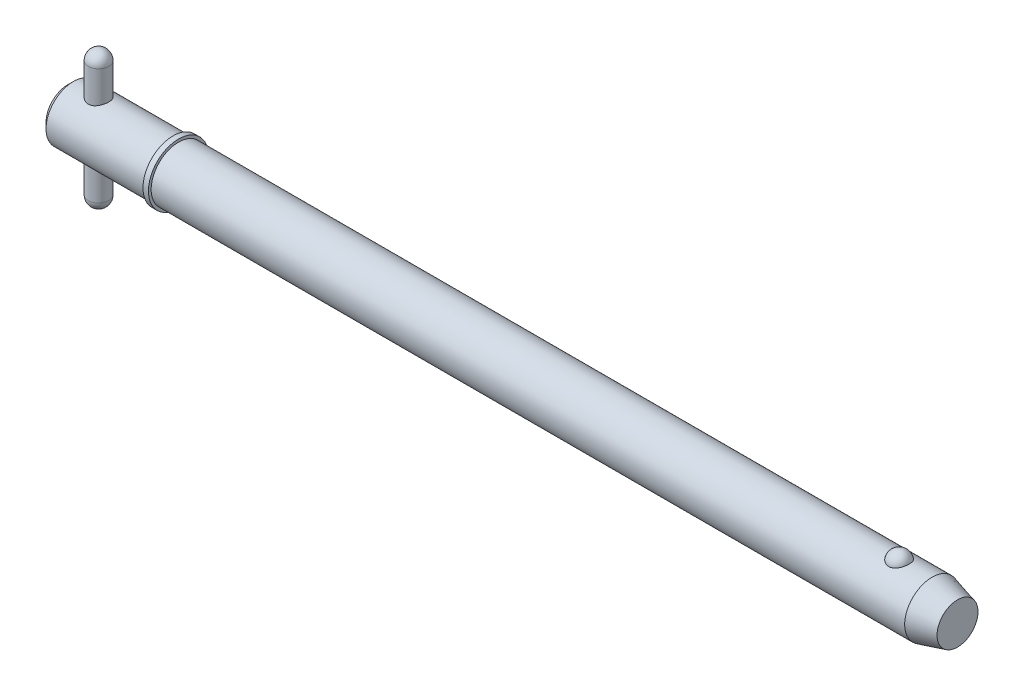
ISO-10303-21;
HEADER;
FILE_DESCRIPTION(('STEP AP214'),'2;1');
FILE_NAME('part.step','',(''),(''),'','','');
FILE_SCHEMA(('AUTOMOTIVE_DESIGN { 1 0 10303 214 1 1 1 1 }'));
ENDSEC;
DATA;
#1=APPLICATION_CONTEXT('core data for automotive mechanical design processes');
#2=APPLICATION_PROTOCOL_DEFINITION('international standard','automotive_design',2000,#1);
#3=PRODUCT_CONTEXT('',#1,'mechanical');
#4=PRODUCT('Part','Part','',(#3));
#5=PRODUCT_RELATED_PRODUCT_CATEGORY('part','',(#4));
#6=PRODUCT_DEFINITION_FORMATION('','',#4);
#7=PRODUCT_DEFINITION_CONTEXT('part definition',#1,'design');
#8=PRODUCT_DEFINITION('design','',#6,#7);
#9=PRODUCT_DEFINITION_SHAPE('','',#8);
#10=(LENGTH_UNIT() NAMED_UNIT(*) SI_UNIT(.MILLI.,.METRE.));
#11=(NAMED_UNIT(*) PLANE_ANGLE_UNIT() SI_UNIT($,.RADIAN.));
#12=(NAMED_UNIT(*) SI_UNIT($,.STERADIAN.) SOLID_ANGLE_UNIT());
#13=UNCERTAINTY_MEASURE_WITH_UNIT(LENGTH_MEASURE(1.E-05),#10,'distance_accuracy_value','');
#14=(GEOMETRIC_REPRESENTATION_CONTEXT(3) GLOBAL_UNCERTAINTY_ASSIGNED_CONTEXT((#13)) GLOBAL_UNIT_ASSIGNED_CONTEXT((#10,
#11,#12)) REPRESENTATION_CONTEXT('',''));
#15=CARTESIAN_POINT('',(0.,0.,0.));
#16=DIRECTION('',(0.,0.,1.));
#17=DIRECTION('',(1.,0.,0.));
#18=AXIS2_PLACEMENT_3D('',#15,#16,#17);
#19=CARTESIAN_POINT('',(7.14,15.875,0.));
#20=DIRECTION('',(0.,-1.,0.));
#21=DIRECTION('',(0.,0.,-1.));
#22=AXIS2_PLACEMENT_3D('',#19,#20,#21);
#23=CYLINDRICAL_SURFACE('',#22,2.38);
#24=CARTESIAN_POINT('',(7.14,-13.495,0.));
#25=DIRECTION('',(0.,-1.,0.));
#26=DIRECTION('',(0.,0.,-1.));
#27=AXIS2_PLACEMENT_3D('',#24,#25,#26);
#28=CIRCLE('',#27,2.38);
#29=CARTESIAN_POINT('',(7.14,-13.495,-2.38));
#30=VERTEX_POINT('',#29);
#31=EDGE_CURVE('P0_E10',#30,#30,#28,.F.);
#32=ORIENTED_EDGE('',*,*,#31,.T.);
#33=EDGE_LOOP('',(#32));
#34=FACE_BOUND('',#33,.T.);
#35=CARTESIAN_POINT('',(7.14,13.495,0.));
#36=DIRECTION('',(0.,-1.,0.));
#37=DIRECTION('',(0.,0.,-1.));
#38=AXIS2_PLACEMENT_3D('',#35,#36,#37);
#39=CIRCLE('',#38,2.38);
#40=CARTESIAN_POINT('',(7.14,13.495,-2.38));
#41=VERTEX_POINT('',#40);
#42=EDGE_CURVE('P0_E21',#41,#41,#39,.T.);
#43=ORIENTED_EDGE('',*,*,#42,.T.);
#44=EDGE_LOOP('',(#43));
#45=FACE_BOUND('',#44,.T.);
#46=ADVANCED_FACE('P0_F14',(#34,#45),#23,.T.);
#47=CARTESIAN_POINT('',(7.14,-13.495,0.));
#48=DIRECTION('',(0.,0.,1.));
#49=DIRECTION('',(1.,0.,0.));
#50=AXIS2_PLACEMENT_3D('',#47,#48,#49);
#51=SPHERICAL_SURFACE('',#50,2.38);
#52=CARTESIAN_POINT('',(7.14,-13.495,0.));
#53=DIRECTION('',(0.,-1.,0.));
#54=DIRECTION('',(0.,0.,-1.));
#55=AXIS2_PLACEMENT_3D('',#52,#53,#54);
#56=SPHERICAL_SURFACE('',#55,2.38);
#57=ORIENTED_EDGE('',*,*,#31,.F.);
#58=EDGE_LOOP('',(#57));
#59=FACE_BOUND('',#58,.T.);
#60=ADVANCED_FACE('P0_F29',(#59),#56,.T.);
#61=CARTESIAN_POINT('',(7.14,13.495,0.));
#62=DIRECTION('',(0.,0.,1.));
#63=DIRECTION('',(1.,0.,0.));
#64=AXIS2_PLACEMENT_3D('',#61,#62,#63);
#65=SPHERICAL_SURFACE('',#64,2.38);
#66=CARTESIAN_POINT('',(7.14,13.495,0.));
#67=DIRECTION('',(0.,-1.,0.));
#68=DIRECTION('',(0.,0.,-1.));
#69=AXIS2_PLACEMENT_3D('',#66,#67,#68);
#70=SPHERICAL_SURFACE('',#69,2.38);
#71=ORIENTED_EDGE('',*,*,#42,.F.);
#72=EDGE_LOOP('',(#71));
#73=FACE_BOUND('',#72,.T.);
#74=ADVANCED_FACE('P0_F16',(#73),#70,.T.);
#75=CLOSED_SHELL('',(#46,#60,#74));
#76=MANIFOLD_SOLID_BREP('P0_B1',#75);
#77=CARTESIAN_POINT('',(0.,0.,0.));
#78=DIRECTION('',(1.,0.,0.));
#79=DIRECTION('',(0.,0.,-1.));
#80=AXIS2_PLACEMENT_3D('',#77,#78,#79);
#81=CYLINDRICAL_SURFACE('',#80,6.35);
#82=CARTESIAN_POINT('',(200.755369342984,0.,0.));
#83=DIRECTION('',(1.,0.,0.));
#84=DIRECTION('',(0.,0.,-1.));
#85=AXIS2_PLACEMENT_3D('',#82,#83,#84);
#86=CIRCLE('',#85,6.35);
#87=CARTESIAN_POINT('',(200.755369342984,0.,-6.35));
#88=VERTEX_POINT('',#87);
#89=EDGE_CURVE('P1_E81',#88,#88,#86,.T.);
#90=ORIENTED_EDGE('',*,*,#89,.F.);
#91=EDGE_LOOP('',(#90));
#92=FACE_BOUND('',#91,.T.);
#93=CARTESIAN_POINT('',(25.7,0.,0.));
#94=DIRECTION('',(1.,0.,0.));
#95=DIRECTION('',(0.,0.,-1.));
#96=AXIS2_PLACEMENT_3D('',#93,#94,#95);
#97=CIRCLE('',#96,6.35);
#98=CARTESIAN_POINT('',(25.7,0.,-6.35));
#99=VERTEX_POINT('',#98);
#100=EDGE_CURVE('P1_E85',#99,#99,#97,.T.);
#101=ORIENTED_EDGE('',*,*,#100,.T.);
#102=EDGE_LOOP('',(#101));
#103=FACE_BOUND('',#102,.T.);
#104=CARTESIAN_POINT('',(193.130021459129,5.87502187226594,2.40969251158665));
#105=CARTESIAN_POINT('',(193.005030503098,5.87501645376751,2.40969773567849));
#106=CARTESIAN_POINT('',(192.880080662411,5.87916061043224,2.39967292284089));
#107=CARTESIAN_POINT('',(192.633909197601,5.89523112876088,2.35991730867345));
#108=CARTESIAN_POINT('',(192.512686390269,5.90715499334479,2.33019283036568));
#109=CARTESIAN_POINT('',(192.277517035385,5.93739567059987,2.25201402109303));
#110=CARTESIAN_POINT('',(192.163560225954,5.95570321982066,2.20358681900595));
#111=CARTESIAN_POINT('',(191.94557352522,5.9967206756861,2.08937987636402));
#112=CARTESIAN_POINT('',(191.841545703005,6.0194314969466,2.02359652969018));
#113=CARTESIAN_POINT('',(191.642943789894,6.06760647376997,1.87428969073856));
#114=CARTESIAN_POINT('',(191.548726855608,6.09313095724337,1.79031110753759));
#115=CARTESIAN_POINT('',(191.375255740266,6.14375873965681,1.60800178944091));
#116=CARTESIAN_POINT('',(191.296004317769,6.16886196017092,1.50966841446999));
#117=CARTESIAN_POINT('',(191.150845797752,6.21724600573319,1.29645884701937));
#118=CARTESIAN_POINT('',(191.085688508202,6.24039621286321,1.1810415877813));
#119=CARTESIAN_POINT('',(190.974703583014,6.28117277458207,0.940351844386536));
#120=CARTESIAN_POINT('',(190.928877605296,6.29879865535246,0.815078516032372));
#121=CARTESIAN_POINT('',(190.857023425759,6.32692073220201,0.556494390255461));
#122=CARTESIAN_POINT('',(190.831249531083,6.33732517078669,0.423102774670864));
#123=CARTESIAN_POINT('',(190.800988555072,6.34957673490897,0.153542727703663));
#124=CARTESIAN_POINT('',(190.796500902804,6.35142408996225,0.0173743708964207));
#125=CARTESIAN_POINT('',(190.808865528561,6.34638925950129,-0.253036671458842));
#126=CARTESIAN_POINT('',(190.825594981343,6.33955731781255,-0.387285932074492));
#127=CARTESIAN_POINT('',(190.879843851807,6.31794129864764,-0.650851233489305));
#128=CARTESIAN_POINT('',(190.917363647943,6.3031570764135,-0.780167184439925));
#129=CARTESIAN_POINT('',(191.012500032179,6.26711642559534,-1.03041949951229));
#130=CARTESIAN_POINT('',(191.070143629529,6.24585130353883,-1.15134433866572));
#131=CARTESIAN_POINT('',(191.204352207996,6.19905619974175,-1.38129800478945));
#132=CARTESIAN_POINT('',(191.280918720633,6.17352587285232,-1.49032586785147));
#133=CARTESIAN_POINT('',(191.451753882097,6.12080227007,-1.69393164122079));
#134=CARTESIAN_POINT('',(191.546100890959,6.09360200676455,-1.78844209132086));
#135=CARTESIAN_POINT('',(191.750119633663,6.04070434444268,-1.95970536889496));
#136=CARTESIAN_POINT('',(191.859790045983,6.015006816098,-2.0364597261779));
#137=CARTESIAN_POINT('',(192.089187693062,5.96867714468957,-2.16845644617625));
#138=CARTESIAN_POINT('',(192.208652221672,5.94794910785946,-2.22412062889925));
#139=CARTESIAN_POINT('',(192.456218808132,5.91340580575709,-2.31440992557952));
#140=CARTESIAN_POINT('',(192.584317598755,5.89958794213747,-2.34904294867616));
#141=CARTESIAN_POINT('',(192.838582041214,5.88111049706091,-2.39491590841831));
#142=CARTESIAN_POINT('',(192.964520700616,5.87602512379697,-2.40724512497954));
#143=CARTESIAN_POINT('',(193.216786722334,5.87428980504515,-2.41147867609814));
#144=CARTESIAN_POINT('',(193.343114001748,5.8776381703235,-2.40338710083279));
#145=CARTESIAN_POINT('',(193.588417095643,5.89212921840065,-2.36762715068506));
#146=CARTESIAN_POINT('',(193.707499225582,5.90302431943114,-2.3405803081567));
#147=CARTESIAN_POINT('',(193.93924472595,5.93113752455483,-2.26839066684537));
#148=CARTESIAN_POINT('',(194.051907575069,5.94835614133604,-2.22324640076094));
#149=CARTESIAN_POINT('',(194.270400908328,5.9877301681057,-2.11493806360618));
#150=CARTESIAN_POINT('',(194.376028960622,6.00998499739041,-2.05140269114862));
#151=CARTESIAN_POINT('',(194.575300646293,6.05690144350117,-1.90842705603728));
#152=CARTESIAN_POINT('',(194.668941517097,6.08156361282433,-1.82898313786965));
#153=CARTESIAN_POINT('',(194.846675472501,6.13211715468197,-1.65182429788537));
#154=CARTESIAN_POINT('',(194.930055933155,6.15800825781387,-1.5533938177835));
#155=CARTESIAN_POINT('',(195.079790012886,6.20712834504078,-1.34374214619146));
#156=CARTESIAN_POINT('',(195.146140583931,6.23035685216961,-1.23251867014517));
#157=CARTESIAN_POINT('',(195.262345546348,6.27251177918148,-0.996447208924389));
#158=CARTESIAN_POINT('',(195.311607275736,6.29127762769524,-0.871278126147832));
#159=CARTESIAN_POINT('',(195.389614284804,6.3215862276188,-0.613870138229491));
#160=CARTESIAN_POINT('',(195.418359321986,6.33312889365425,-0.481631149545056));
#161=CARTESIAN_POINT('',(195.454770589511,6.34782349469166,-0.213672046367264));
#162=CARTESIAN_POINT('',(195.462413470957,6.35096613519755,-0.0779482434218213));
#163=CARTESIAN_POINT('',(195.456395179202,6.34851322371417,0.192943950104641));
#164=CARTESIAN_POINT('',(195.442734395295,6.3429178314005,0.328112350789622));
#165=CARTESIAN_POINT('',(195.39450361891,6.32360512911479,0.593406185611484));
#166=CARTESIAN_POINT('',(195.360031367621,6.30992579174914,0.723552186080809));
#167=CARTESIAN_POINT('',(195.270953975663,6.27586325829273,0.97583417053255));
#168=CARTESIAN_POINT('',(195.21634761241,6.25547965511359,1.09796966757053));
#169=CARTESIAN_POINT('',(195.08775879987,6.20998183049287,1.33148921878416));
#170=CARTESIAN_POINT('',(195.013674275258,6.18484288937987,1.44281227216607));
#171=CARTESIAN_POINT('',(194.847820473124,6.13258735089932,1.65087683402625));
#172=CARTESIAN_POINT('',(194.756051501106,6.10547078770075,1.7476185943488));
#173=CARTESIAN_POINT('',(194.557183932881,6.05235879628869,1.92350926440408));
#174=CARTESIAN_POINT('',(194.450133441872,6.02636017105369,2.00271146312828));
#175=CARTESIAN_POINT('',(194.223138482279,5.97843747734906,2.14154159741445));
#176=CARTESIAN_POINT('',(194.103191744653,5.9565141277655,2.20116608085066));
#177=CARTESIAN_POINT('',(193.844523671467,5.91812106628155,2.30250570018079));
#178=CARTESIAN_POINT('',(193.70506980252,5.90217533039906,2.34256795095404));
#179=CARTESIAN_POINT('',(193.420397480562,5.88063128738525,2.3961521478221));
#180=CARTESIAN_POINT('',(193.27518174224,5.87502816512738,2.40968644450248));
#181=CARTESIAN_POINT('',(193.130021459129,5.87502187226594,2.40969251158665));
#182=B_SPLINE_CURVE_WITH_KNOTS('',3,(#104,#105,#106,#107,#108,#109,#110,#111,#112,#113,#114,
#115,#116,#117,#118,#119,#120,#121,#122,#123,#124,#125,#126,#127,#128,#129,#130,#131,#132,#133,
#134,#135,#136,#137,#138,#139,#140,#141,#142,#143,#144,#145,#146,#147,#148,#149,#150,#151,#152,
#153,#154,#155,#156,#157,#158,#159,#160,#161,#162,#163,#164,#165,#166,#167,#168,#169,#170,#171,
#172,#173,#174,#175,#176,#177,#178,#179,#180,#181),.UNSPECIFIED.,.T.,.F.,(4,2,2,2,2,2,2,2,2,2,2,
2,2,2,2,2,2,2,2,2,2,2,2,2,2,2,2,2,2,2,2,2,2,2,2,2,2,2,4),(0.,0.374440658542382,
0.748761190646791,1.12254078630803,1.4963981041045,1.88098871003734,2.26565013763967,
2.66741104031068,3.06920639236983,3.47601794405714,3.88281858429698,4.28727498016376,
4.69173873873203,5.09674745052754,5.50178895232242,5.90865911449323,6.31549420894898,
6.71369855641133,7.11175305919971,7.48978077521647,7.86773278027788,8.23383886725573,
8.59997464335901,8.97409044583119,9.34829231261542,9.74122667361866,10.1342313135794,
10.5397522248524,10.9452779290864,11.3512521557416,11.75721896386,12.1612938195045,
12.5653932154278,12.9716540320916,13.3779078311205,13.7829098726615,14.1879832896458,
14.6230486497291,15.0579114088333),.UNSPECIFIED.);
#183=CARTESIAN_POINT('',(193.130021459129,5.87502187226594,2.40969251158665));
#184=VERTEX_POINT('',#183);
#185=EDGE_CURVE('P1_E35',#184,#184,#182,.T.);
#186=ORIENTED_EDGE('',*,*,#185,.T.);
#187=EDGE_LOOP('',(#186));
#188=FACE_BOUND('',#187,.T.);
#189=ADVANCED_FACE('P1_F13',(#92,#103,#188),#81,.T.);
#190=CARTESIAN_POINT('',(0.,0.,0.));
#191=DIRECTION('',(-1.,0.,0.));
#192=DIRECTION('',(0.,0.,1.));
#193=AXIS2_PLACEMENT_3D('',#190,#191,#192);
#194=PLANE('',#193);
#195=CARTESIAN_POINT('',(0.,0.,0.));
#196=DIRECTION('',(1.,0.,0.));
#197=DIRECTION('',(0.,0.,-1.));
#198=AXIS2_PLACEMENT_3D('',#195,#196,#197);
#199=CIRCLE('',#198,5.08);
#200=CARTESIAN_POINT('',(0.,0.,-5.08));
#201=VERTEX_POINT('',#200);
#202=EDGE_CURVE('P1_E9',#201,#201,#199,.T.);
#203=ORIENTED_EDGE('',*,*,#202,.F.);
#204=EDGE_LOOP('',(#203));
#205=FACE_BOUND('',#204,.T.);
#206=ADVANCED_FACE('P1_F15',(#205),#194,.T.);
#207=CARTESIAN_POINT('',(1.27,0.,0.));
#208=DIRECTION('',(1.,0.,0.));
#209=DIRECTION('',(0.,0.,-1.));
#210=AXIS2_PLACEMENT_3D('',#207,#208,#209);
#211=CONICAL_SURFACE('',#210,6.35,0.78539816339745);
#212=ORIENTED_EDGE('',*,*,#202,.T.);
#213=EDGE_LOOP('',(#212));
#214=FACE_BOUND('',#213,.T.);
#215=CARTESIAN_POINT('',(1.27,0.,0.));
#216=DIRECTION('',(1.,0.,0.));
#217=DIRECTION('',(0.,0.,-1.));
#218=AXIS2_PLACEMENT_3D('',#215,#216,#217);
#219=CIRCLE('',#218,6.35);
#220=CARTESIAN_POINT('',(1.27,0.,-6.35));
#221=VERTEX_POINT('',#220);
#222=EDGE_CURVE('P1_E26',#221,#221,#219,.T.);
#223=ORIENTED_EDGE('',*,*,#222,.F.);
#224=EDGE_LOOP('',(#223));
#225=FACE_BOUND('',#224,.T.);
#226=ADVANCED_FACE('P1_F77',(#214,#225),#211,.T.);
#227=CARTESIAN_POINT('',(0.,0.,0.));
#228=DIRECTION('',(1.,0.,0.));
#229=DIRECTION('',(0.,0.,-1.));
#230=AXIS2_PLACEMENT_3D('',#227,#228,#229);
#231=CYLINDRICAL_SURFACE('',#230,6.35);
#232=CARTESIAN_POINT('',(7.14,-5.88711304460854,2.38));
#233=CARTESIAN_POINT('',(7.01146258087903,-5.88710856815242,2.38000480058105));
#234=CARTESIAN_POINT('',(6.88295682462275,-5.89136840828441,2.36955244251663));
#235=CARTESIAN_POINT('',(6.62981934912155,-5.90782785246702,2.32820953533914));
#236=CARTESIAN_POINT('',(6.50518751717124,-5.92002722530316,2.29731958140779));
#237=CARTESIAN_POINT('',(6.26352403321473,-5.95079384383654,2.21639366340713));
#238=CARTESIAN_POINT('',(6.14647496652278,-5.96934583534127,2.16640353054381));
#239=CARTESIAN_POINT('',(5.92237941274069,-6.01070278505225,2.04885862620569));
#240=CARTESIAN_POINT('',(5.81533593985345,-6.03350901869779,1.98129858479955));
#241=CARTESIAN_POINT('',(5.60897525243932,-6.08207341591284,1.82693902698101));
#242=CARTESIAN_POINT('',(5.51022503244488,-6.10791836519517,1.73940861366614));
#243=CARTESIAN_POINT('',(5.32840561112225,-6.15892405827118,1.54914379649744));
#244=CARTESIAN_POINT('',(5.24533975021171,-6.1840846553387,1.44640616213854));
#245=CARTESIAN_POINT('',(5.09451639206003,-6.23191821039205,1.22434014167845));
#246=CARTESIAN_POINT('',(5.02737511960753,-6.25447755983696,1.10456656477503));
#247=CARTESIAN_POINT('',(4.91443001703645,-6.2935236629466,0.854429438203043));
#248=CARTESIAN_POINT('',(4.86861879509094,-6.31001251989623,0.724069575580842));
#249=CARTESIAN_POINT('',(4.80162253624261,-6.33444370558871,0.46242122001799));
#250=CARTESIAN_POINT('',(4.77946137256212,-6.34272370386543,0.331414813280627));
#251=CARTESIAN_POINT('',(4.75726677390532,-6.35101600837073,0.0672982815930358));
#252=CARTESIAN_POINT('',(4.75722615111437,-6.35103100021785,-0.0658111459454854));
#253=CARTESIAN_POINT('',(4.77870510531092,-6.3430064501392,-0.323358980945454));
#254=CARTESIAN_POINT('',(4.79915922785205,-6.33536494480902,-0.447900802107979));
#255=CARTESIAN_POINT('',(4.85925493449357,-6.31340794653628,-0.69163609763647));
#256=CARTESIAN_POINT('',(4.89889787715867,-6.29909198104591,-0.810829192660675));
#257=CARTESIAN_POINT('',(4.9967414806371,-6.26494471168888,-1.04254212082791));
#258=CARTESIAN_POINT('',(5.05520370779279,-6.24503620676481,-1.1549396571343));
#259=CARTESIAN_POINT('',(5.1887948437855,-6.20171869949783,-1.3686079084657));
#260=CARTESIAN_POINT('',(5.26392912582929,-6.17830856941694,-1.46987502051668));
#261=CARTESIAN_POINT('',(5.43386591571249,-6.12878580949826,-1.66468415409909));
#262=CARTESIAN_POINT('',(5.52956139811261,-6.10259519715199,-1.75742857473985));
#263=CARTESIAN_POINT('',(5.73530435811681,-6.05155777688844,-1.92585331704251));
#264=CARTESIAN_POINT('',(5.84535542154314,-6.02671130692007,-2.00152936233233));
#265=CARTESIAN_POINT('',(6.07982989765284,-5.98068420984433,-2.13519109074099));
#266=CARTESIAN_POINT('',(6.20451768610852,-5.95959698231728,-2.19274775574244));
#267=CARTESIAN_POINT('',(6.4628145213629,-5.92455622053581,-2.28574558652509));
#268=CARTESIAN_POINT('',(6.59641856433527,-5.91059872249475,-2.32119904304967));
#269=CARTESIAN_POINT('',(6.86087441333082,-5.8923327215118,-2.36717069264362));
#270=CARTESIAN_POINT('',(6.99147192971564,-5.8875347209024,-2.37895573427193));
#271=CARTESIAN_POINT('',(7.25283805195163,-5.88674545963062,-2.38091046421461));
#272=CARTESIAN_POINT('',(7.38360660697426,-5.89075200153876,-2.37108554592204));
#273=CARTESIAN_POINT('',(7.63510696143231,-5.90662331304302,-2.33124781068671));
#274=CARTESIAN_POINT('',(7.75602069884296,-5.91810660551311,-2.30221396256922));
#275=CARTESIAN_POINT('',(7.99120505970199,-5.94718527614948,-2.22601401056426));
#276=CARTESIAN_POINT('',(8.10547431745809,-5.96478190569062,-2.17884419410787));
#277=CARTESIAN_POINT('',(8.32888632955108,-6.00491533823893,-2.06572311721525));
#278=CARTESIAN_POINT('',(8.43767672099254,-6.02761250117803,-1.99913452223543));
#279=CARTESIAN_POINT('',(8.6429894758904,-6.07511988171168,-1.84974438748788));
#280=CARTESIAN_POINT('',(8.73950733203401,-6.09993087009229,-1.76693691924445));
#281=CARTESIAN_POINT('',(8.9238741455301,-6.1507686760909,-1.58125563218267));
#282=CARTESIAN_POINT('',(9.01078732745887,-6.17677301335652,-1.47744327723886));
#283=CARTESIAN_POINT('',(9.16607127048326,-6.22556172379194,-1.25606967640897));
#284=CARTESIAN_POINT('',(9.23444197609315,-6.24834608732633,-1.13850838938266));
#285=CARTESIAN_POINT('',(9.3502493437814,-6.28811144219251,-0.893050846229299));
#286=CARTESIAN_POINT('',(9.39775808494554,-6.30511236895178,-0.765192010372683));
#287=CARTESIAN_POINT('',(9.47032640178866,-6.33145833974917,-0.502514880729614));
#288=CARTESIAN_POINT('',(9.49539651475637,-6.34080697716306,-0.367699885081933));
#289=CARTESIAN_POINT('',(9.52124059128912,-6.35045496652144,-0.103396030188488));
#290=CARTESIAN_POINT('',(9.52334421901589,-6.35124952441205,0.025945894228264));
#291=CARTESIAN_POINT('',(9.50661518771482,-6.34499064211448,0.283061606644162));
#292=CARTESIAN_POINT('',(9.48778504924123,-6.33793814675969,0.410835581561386));
#293=CARTESIAN_POINT('',(9.43065630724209,-6.31700307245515,0.658028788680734));
#294=CARTESIAN_POINT('',(9.39284291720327,-6.30329098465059,0.7775756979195));
#295=CARTESIAN_POINT('',(9.29930406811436,-6.27046903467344,1.00863789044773));
#296=CARTESIAN_POINT('',(9.2435752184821,-6.25135815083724,1.12015164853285));
#297=CARTESIAN_POINT('',(9.11312349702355,-6.20865254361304,1.33711407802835));
#298=CARTESIAN_POINT('',(9.03770094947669,-6.18490316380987,1.44211105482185));
#299=CARTESIAN_POINT('',(8.87110640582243,-6.13583718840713,1.63836897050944));
#300=CARTESIAN_POINT('',(8.77992879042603,-6.11052003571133,1.72962498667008));
#301=CARTESIAN_POINT('',(8.57869799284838,-6.05953829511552,1.90076098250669));
#302=CARTESIAN_POINT('',(8.46790320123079,-6.03392573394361,1.97978778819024));
#303=CARTESIAN_POINT('',(8.23379693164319,-5.98676607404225,2.11813466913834));
#304=CARTESIAN_POINT('',(8.11048418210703,-5.9652193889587,2.17745273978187));
#305=CARTESIAN_POINT('',(7.84900037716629,-5.92818393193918,2.27641807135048));
#306=CARTESIAN_POINT('',(7.71041678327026,-5.91299857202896,2.31510015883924));
#307=CARTESIAN_POINT('',(7.42787316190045,-5.89246887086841,2.36688002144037));
#308=CARTESIAN_POINT('',(7.28391673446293,-5.88711805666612,2.37999462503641));
#309=CARTESIAN_POINT('',(7.14,-5.88711304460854,2.38));
#310=B_SPLINE_CURVE_WITH_KNOTS('',3,(#232,#233,#234,#235,#236,#237,#238,#239,#240,#241,#242,
#243,#244,#245,#246,#247,#248,#249,#250,#251,#252,#253,#254,#255,#256,#257,#258,#259,#260,#261,
#262,#263,#264,#265,#266,#267,#268,#269,#270,#271,#272,#273,#274,#275,#276,#277,#278,#279,#280,
#281,#282,#283,#284,#285,#286,#287,#288,#289,#290,#291,#292,#293,#294,#295,#296,#297,#298,#299,
#300,#301,#302,#303,#304,#305,#306,#307,#308,#309),.UNSPECIFIED.,.T.,.F.,(4,2,2,2,2,2,2,2,2,2,2,
2,2,2,2,2,2,2,2,2,2,2,2,2,2,2,2,2,2,2,2,2,2,2,2,2,2,2,4),(0.,0.385076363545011,
0.770141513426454,1.15428843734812,1.53855071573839,1.94016118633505,2.3418570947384,
2.75720522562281,3.1724093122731,3.569721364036,3.96690431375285,4.34445758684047,
4.72203759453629,5.10511017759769,5.48830640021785,5.89390240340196,6.29959991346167,
6.71428455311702,7.12873839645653,7.52034494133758,7.91185376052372,8.28480528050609,
8.65783318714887,9.0448340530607,9.43197664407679,9.84363087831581,10.2552863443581,
10.6655081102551,11.0755371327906,11.4616919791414,11.847800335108,12.224507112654,
12.6012852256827,12.9938941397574,13.386643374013,13.8000944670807,14.2135876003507,
14.6450218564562,15.0761720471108),.UNSPECIFIED.);
#311=CARTESIAN_POINT('',(7.14,-5.88711304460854,2.38));
#312=VERTEX_POINT('',#311);
#313=EDGE_CURVE('P1_E17',#312,#312,#310,.T.);
#314=ORIENTED_EDGE('',*,*,#313,.F.);
#315=EDGE_LOOP('',(#314));
#316=FACE_BOUND('',#315,.T.);
#317=CARTESIAN_POINT('',(7.14,5.88711304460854,2.38));
#318=CARTESIAN_POINT('',(7.26853741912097,5.88710856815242,2.38000480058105));
#319=CARTESIAN_POINT('',(7.39704317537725,5.89136840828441,2.36955244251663));
#320=CARTESIAN_POINT('',(7.65018065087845,5.90782785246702,2.32820953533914));
#321=CARTESIAN_POINT('',(7.77481248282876,5.92002722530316,2.29731958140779));
#322=CARTESIAN_POINT('',(8.01647596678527,5.95079384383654,2.21639366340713));
#323=CARTESIAN_POINT('',(8.13352503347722,5.96934583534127,2.16640353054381));
#324=CARTESIAN_POINT('',(8.35762058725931,6.01070278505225,2.04885862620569));
#325=CARTESIAN_POINT('',(8.46466406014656,6.03350901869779,1.98129858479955));
#326=CARTESIAN_POINT('',(8.67102474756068,6.08207341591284,1.82693902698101));
#327=CARTESIAN_POINT('',(8.76977496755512,6.10791836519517,1.73940861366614));
#328=CARTESIAN_POINT('',(8.95159438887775,6.15892405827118,1.54914379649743));
#329=CARTESIAN_POINT('',(9.03466024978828,6.1840846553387,1.44640616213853));
#330=CARTESIAN_POINT('',(9.18548360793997,6.23191821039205,1.22434014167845));
#331=CARTESIAN_POINT('',(9.25262488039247,6.25447755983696,1.10456656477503));
#332=CARTESIAN_POINT('',(9.36556998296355,6.2935236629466,0.854429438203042));
#333=CARTESIAN_POINT('',(9.41138120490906,6.31001251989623,0.72406957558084));
#334=CARTESIAN_POINT('',(9.47837746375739,6.33444370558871,0.462421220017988));
#335=CARTESIAN_POINT('',(9.50053862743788,6.34272370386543,0.331414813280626));
#336=CARTESIAN_POINT('',(9.52273322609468,6.35101600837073,0.0672982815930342));
#337=CARTESIAN_POINT('',(9.52277384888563,6.35103100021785,-0.0658111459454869));
#338=CARTESIAN_POINT('',(9.50129489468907,6.3430064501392,-0.323358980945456));
#339=CARTESIAN_POINT('',(9.48084077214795,6.33536494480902,-0.447900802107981));
#340=CARTESIAN_POINT('',(9.42074506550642,6.31340794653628,-0.691636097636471));
#341=CARTESIAN_POINT('',(9.38110212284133,6.29909198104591,-0.810829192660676));
#342=CARTESIAN_POINT('',(9.2832585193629,6.26494471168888,-1.04254212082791));
#343=CARTESIAN_POINT('',(9.22479629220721,6.24503620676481,-1.1549396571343));
#344=CARTESIAN_POINT('',(9.0912051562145,6.20171869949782,-1.3686079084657));
#345=CARTESIAN_POINT('',(9.0160708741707,6.17830856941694,-1.46987502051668));
#346=CARTESIAN_POINT('',(8.84613408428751,6.12878580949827,-1.66468415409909));
#347=CARTESIAN_POINT('',(8.75043860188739,6.10259519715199,-1.75742857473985));
#348=CARTESIAN_POINT('',(8.54469564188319,6.05155777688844,-1.92585331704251));
#349=CARTESIAN_POINT('',(8.43464457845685,6.02671130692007,-2.00152936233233));
#350=CARTESIAN_POINT('',(8.20017010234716,5.98068420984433,-2.13519109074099));
#351=CARTESIAN_POINT('',(8.07548231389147,5.95959698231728,-2.19274775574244));
#352=CARTESIAN_POINT('',(7.8171854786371,5.9245562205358,-2.28574558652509));
#353=CARTESIAN_POINT('',(7.68358143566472,5.91059872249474,-2.32119904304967));
#354=CARTESIAN_POINT('',(7.41912558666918,5.8923327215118,-2.36717069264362));
#355=CARTESIAN_POINT('',(7.28852807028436,5.8875347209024,-2.37895573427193));
#356=CARTESIAN_POINT('',(7.02716194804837,5.88674545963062,-2.38091046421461));
#357=CARTESIAN_POINT('',(6.89639339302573,5.89075200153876,-2.37108554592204));
#358=CARTESIAN_POINT('',(6.64489303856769,5.90662331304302,-2.33124781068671));
#359=CARTESIAN_POINT('',(6.52397930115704,5.91810660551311,-2.30221396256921));
#360=CARTESIAN_POINT('',(6.288794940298,5.94718527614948,-2.22601401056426));
#361=CARTESIAN_POINT('',(6.17452568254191,5.96478190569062,-2.17884419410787));
#362=CARTESIAN_POINT('',(5.95111367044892,6.00491533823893,-2.06572311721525));
#363=CARTESIAN_POINT('',(5.84232327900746,6.02761250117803,-1.99913452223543));
#364=CARTESIAN_POINT('',(5.6370105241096,6.07511988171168,-1.84974438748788));
#365=CARTESIAN_POINT('',(5.54049266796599,6.09993087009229,-1.76693691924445));
#366=CARTESIAN_POINT('',(5.3561258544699,6.1507686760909,-1.58125563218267));
#367=CARTESIAN_POINT('',(5.26921267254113,6.17677301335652,-1.47744327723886));
#368=CARTESIAN_POINT('',(5.11392872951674,6.22556172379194,-1.25606967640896));
#369=CARTESIAN_POINT('',(5.04555802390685,6.24834608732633,-1.13850838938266));
#370=CARTESIAN_POINT('',(4.9297506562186,6.28811144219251,-0.893050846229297));
#371=CARTESIAN_POINT('',(4.88224191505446,6.30511236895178,-0.76519201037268));
#372=CARTESIAN_POINT('',(4.80967359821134,6.33145833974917,-0.502514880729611));
#373=CARTESIAN_POINT('',(4.78460348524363,6.34080697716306,-0.36769988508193));
#374=CARTESIAN_POINT('',(4.75875940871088,6.35045496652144,-0.103396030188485));
#375=CARTESIAN_POINT('',(4.75665578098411,6.35124952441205,0.025945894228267));
#376=CARTESIAN_POINT('',(4.77338481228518,6.34499064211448,0.283061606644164));
#377=CARTESIAN_POINT('',(4.79221495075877,6.33793814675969,0.410835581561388));
#378=CARTESIAN_POINT('',(4.84934369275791,6.31700307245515,0.658028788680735));
#379=CARTESIAN_POINT('',(4.88715708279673,6.30329098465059,0.777575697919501));
#380=CARTESIAN_POINT('',(4.98069593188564,6.27046903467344,1.00863789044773));
#381=CARTESIAN_POINT('',(5.0364247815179,6.25135815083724,1.12015164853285));
#382=CARTESIAN_POINT('',(5.16687650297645,6.20865254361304,1.33711407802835));
#383=CARTESIAN_POINT('',(5.24229905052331,6.18490316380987,1.44211105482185));
#384=CARTESIAN_POINT('',(5.40889359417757,6.13583718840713,1.63836897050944));
#385=CARTESIAN_POINT('',(5.50007120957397,6.11052003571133,1.72962498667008));
#386=CARTESIAN_POINT('',(5.70130200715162,6.05953829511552,1.90076098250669));
#387=CARTESIAN_POINT('',(5.81209679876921,6.03392573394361,1.97978778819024));
#388=CARTESIAN_POINT('',(6.04620306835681,5.98676607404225,2.11813466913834));
#389=CARTESIAN_POINT('',(6.16951581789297,5.9652193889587,2.17745273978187));
#390=CARTESIAN_POINT('',(6.43099962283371,5.92818393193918,2.27641807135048));
#391=CARTESIAN_POINT('',(6.56958321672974,5.91299857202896,2.31510015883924));
#392=CARTESIAN_POINT('',(6.85212683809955,5.89246887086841,2.36688002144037));
#393=CARTESIAN_POINT('',(6.99608326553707,5.88711805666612,2.37999462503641));
#394=CARTESIAN_POINT('',(7.14,5.88711304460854,2.38));
#395=B_SPLINE_CURVE_WITH_KNOTS('',3,(#317,#318,#319,#320,#321,#322,#323,#324,#325,#326,#327,
#328,#329,#330,#331,#332,#333,#334,#335,#336,#337,#338,#339,#340,#341,#342,#343,#344,#345,#346,
#347,#348,#349,#350,#351,#352,#353,#354,#355,#356,#357,#358,#359,#360,#361,#362,#363,#364,#365,
#366,#367,#368,#369,#370,#371,#372,#373,#374,#375,#376,#377,#378,#379,#380,#381,#382,#383,#384,
#385,#386,#387,#388,#389,#390,#391,#392,#393,#394),.UNSPECIFIED.,.T.,.F.,(4,2,2,2,2,2,2,2,2,2,2,
2,2,2,2,2,2,2,2,2,2,2,2,2,2,2,2,2,2,2,2,2,2,2,2,2,2,2,4),(0.,0.385076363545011,
0.770141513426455,1.15428843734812,1.53855071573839,1.94016118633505,2.3418570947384,
2.75720522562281,3.1724093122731,3.56972136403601,3.96690431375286,4.34445758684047,
4.72203759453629,5.10511017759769,5.48830640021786,5.89390240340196,6.29959991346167,
6.71428455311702,7.12873839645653,7.52034494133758,7.91185376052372,8.2848052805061,
8.65783318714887,9.0448340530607,9.43197664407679,9.84363087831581,10.2552863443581,
10.6655081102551,11.0755371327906,11.4616919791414,11.847800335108,12.2245071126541,
12.6012852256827,12.9938941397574,13.386643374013,13.8000944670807,14.2135876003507,
14.6450218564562,15.0761720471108),.UNSPECIFIED.);
#396=CARTESIAN_POINT('',(7.14,5.88711304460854,2.38));
#397=VERTEX_POINT('',#396);
#398=EDGE_CURVE('P1_E43',#397,#397,#395,.T.);
#399=ORIENTED_EDGE('',*,*,#398,.F.);
#400=EDGE_LOOP('',(#399));
#401=FACE_BOUND('',#400,.T.);
#402=ORIENTED_EDGE('',*,*,#222,.T.);
#403=EDGE_LOOP('',(#402));
#404=FACE_BOUND('',#403,.T.);
#405=CARTESIAN_POINT('',(24.43,0.,0.));
#406=DIRECTION('',(1.,0.,0.));
#407=DIRECTION('',(0.,0.,-1.));
#408=AXIS2_PLACEMENT_3D('',#405,#406,#407);
#409=CIRCLE('',#408,6.35);
#410=CARTESIAN_POINT('',(24.43,0.,-6.35));
#411=VERTEX_POINT('',#410);
#412=EDGE_CURVE('P1_E31',#411,#411,#409,.T.);
#413=ORIENTED_EDGE('',*,*,#412,.F.);
#414=EDGE_LOOP('',(#413));
#415=FACE_BOUND('',#414,.T.);
#416=ADVANCED_FACE('P1_F103',(#316,#401,#404,#415),#231,.T.);
#417=CARTESIAN_POINT('',(24.43,6.35,0.));
#418=DIRECTION('',(-1.,0.,0.));
#419=DIRECTION('',(0.,0.,1.));
#420=AXIS2_PLACEMENT_3D('',#417,#418,#419);
#421=PLANE('',#420);
#422=ORIENTED_EDGE('',*,*,#412,.T.);
#423=EDGE_LOOP('',(#422));
#424=FACE_BOUND('',#423,.T.);
#425=CARTESIAN_POINT('',(24.43,0.,0.));
#426=DIRECTION('',(1.,0.,0.));
#427=DIRECTION('',(0.,0.,-1.));
#428=AXIS2_PLACEMENT_3D('',#425,#426,#427);
#429=CIRCLE('',#428,6.985);
#430=CARTESIAN_POINT('',(24.43,0.,-6.985));
#431=VERTEX_POINT('',#430);
#432=EDGE_CURVE('P1_E91',#431,#431,#429,.T.);
#433=ORIENTED_EDGE('',*,*,#432,.F.);
#434=EDGE_LOOP('',(#433));
#435=FACE_BOUND('',#434,.T.);
#436=ADVANCED_FACE('P1_F100',(#424,#435),#421,.T.);
#437=CARTESIAN_POINT('',(0.,0.,0.));
#438=DIRECTION('',(1.,0.,0.));
#439=DIRECTION('',(0.,0.,-1.));
#440=AXIS2_PLACEMENT_3D('',#437,#438,#439);
#441=CYLINDRICAL_SURFACE('',#440,6.985);
#442=ORIENTED_EDGE('',*,*,#432,.T.);
#443=EDGE_LOOP('',(#442));
#444=FACE_BOUND('',#443,.T.);
#445=CARTESIAN_POINT('',(25.7,0.,0.));
#446=DIRECTION('',(1.,0.,0.));
#447=DIRECTION('',(0.,0.,-1.));
#448=AXIS2_PLACEMENT_3D('',#445,#446,#447);
#449=CIRCLE('',#448,6.985);
#450=CARTESIAN_POINT('',(25.7,0.,-6.985));
#451=VERTEX_POINT('',#450);
#452=EDGE_CURVE('P1_E88',#451,#451,#449,.T.);
#453=ORIENTED_EDGE('',*,*,#452,.F.);
#454=EDGE_LOOP('',(#453));
#455=FACE_BOUND('',#454,.T.);
#456=ADVANCED_FACE('P1_F68',(#444,#455),#441,.T.);
#457=CARTESIAN_POINT('',(25.7,6.985,0.));
#458=DIRECTION('',(1.,0.,0.));
#459=DIRECTION('',(0.,0.,-1.));
#460=AXIS2_PLACEMENT_3D('',#457,#458,#459);
#461=PLANE('',#460);
#462=ORIENTED_EDGE('',*,*,#452,.T.);
#463=EDGE_LOOP('',(#462));
#464=FACE_BOUND('',#463,.T.);
#465=ORIENTED_EDGE('',*,*,#100,.F.);
#466=EDGE_LOOP('',(#465));
#467=FACE_BOUND('',#466,.T.);
#468=ADVANCED_FACE('P1_F62',(#464,#467),#461,.T.);
#469=CARTESIAN_POINT('',(206.68,0.,0.));
#470=DIRECTION('',(-1.,0.,0.));
#471=DIRECTION('',(0.,0.,1.));
#472=AXIS2_PLACEMENT_3D('',#469,#470,#471);
#473=CONICAL_SURFACE('',#472,4.76250000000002,0.26179938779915);
#474=ORIENTED_EDGE('',*,*,#89,.T.);
#475=EDGE_LOOP('',(#474));
#476=FACE_BOUND('',#475,.T.);
#477=CARTESIAN_POINT('',(206.68,0.,0.));
#478=DIRECTION('',(1.,0.,0.));
#479=DIRECTION('',(0.,0.,-1.));
#480=AXIS2_PLACEMENT_3D('',#477,#478,#479);
#481=CIRCLE('',#480,4.76250000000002);
#482=CARTESIAN_POINT('',(206.68,0.,-4.76250000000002));
#483=VERTEX_POINT('',#482);
#484=EDGE_CURVE('P1_E42',#483,#483,#481,.T.);
#485=ORIENTED_EDGE('',*,*,#484,.F.);
#486=EDGE_LOOP('',(#485));
#487=FACE_BOUND('',#486,.T.);
#488=ADVANCED_FACE('P1_F59',(#476,#487),#473,.T.);
#489=CARTESIAN_POINT('',(206.68,4.76250000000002,0.));
#490=DIRECTION('',(1.,0.,0.));
#491=DIRECTION('',(0.,0.,-1.));
#492=AXIS2_PLACEMENT_3D('',#489,#490,#491);
#493=PLANE('',#492);
#494=ORIENTED_EDGE('',*,*,#484,.T.);
#495=EDGE_LOOP('',(#494));
#496=FACE_BOUND('',#495,.T.);
#497=ADVANCED_FACE('P1_F55',(#496),#493,.T.);
#498=CARTESIAN_POINT('',(193.130021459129,5.715,0.));
#499=DIRECTION('',(-1.,0.,0.));
#500=DIRECTION('',(0.,1.,0.));
#501=AXIS2_PLACEMENT_3D('',#498,#499,#500);
#502=SPHERICAL_SURFACE('',#501,2.41500000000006);
#503=ORIENTED_EDGE('',*,*,#185,.F.);
#504=EDGE_LOOP('',(#503));
#505=FACE_BOUND('',#504,.T.);
#506=ADVANCED_FACE('P1_F50',(#505),#502,.T.);
#507=CARTESIAN_POINT('',(7.14,-6.985,0.));
#508=DIRECTION('',(0.,1.,0.));
#509=DIRECTION('',(0.,0.,1.));
#510=AXIS2_PLACEMENT_3D('',#507,#508,#509);
#511=CYLINDRICAL_SURFACE('',#510,2.38);
#512=ORIENTED_EDGE('',*,*,#313,.T.);
#513=EDGE_LOOP('',(#512));
#514=FACE_BOUND('',#513,.T.);
#515=ORIENTED_EDGE('',*,*,#398,.T.);
#516=EDGE_LOOP('',(#515));
#517=FACE_BOUND('',#516,.T.);
#518=ADVANCED_FACE('P1_F54',(#514,#517),#511,.F.);
#519=CLOSED_SHELL('',(#189,#206,#226,#416,#436,#456,#468,#488,#497,#506,#518));
#520=MANIFOLD_SOLID_BREP('P1_B1',#519);
#521=ADVANCED_BREP_SHAPE_REPRESENTATION('',(#18,#76,#520),#14);
#522=SHAPE_DEFINITION_REPRESENTATION(#9,#521);
ENDSEC;
END-ISO-10303-21;
